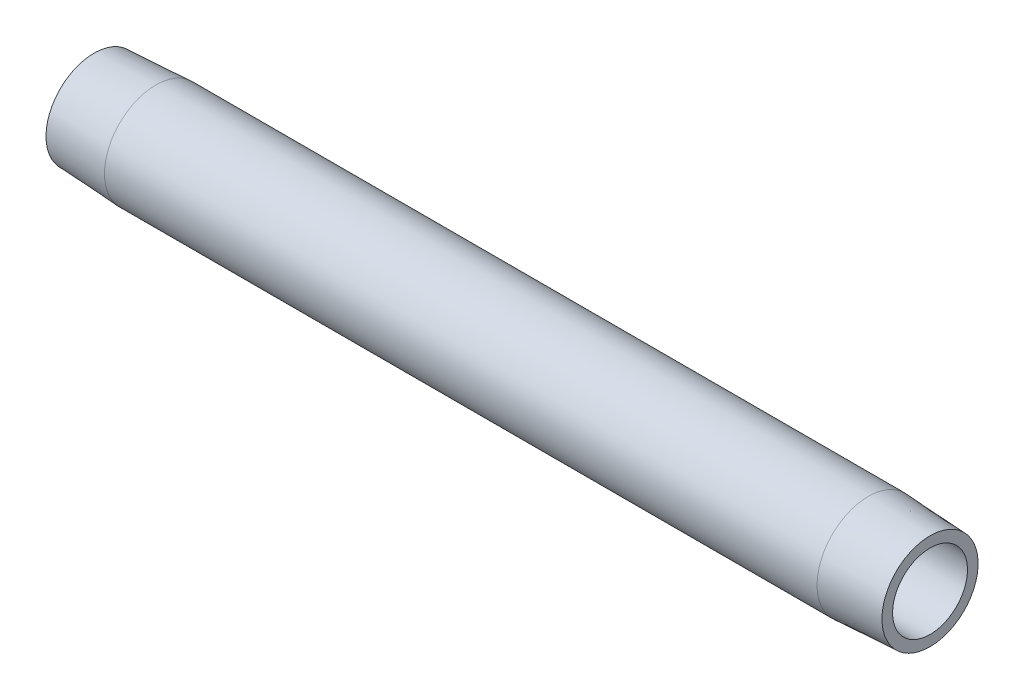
from build123d import *


with BuildPart() as part:
    # Sketch1 → Revolve1 (revolve)
    with BuildSketch(Plane.XY, mode=Mode.PRIVATE) as revolve1_sk:
        Polygon((139.7, 6.2611), (0, 6.2611), (0, 8.032050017), (10.3124, 8.5725), (129.3876, 8.5725), (139.7, 8.032050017), align=None)
    revolve(revolve1_sk.sketch.rotate(Axis((0, 0, 0), (1, 0, 0)), 90), axis=Axis((0, 0, 0), (1, 0, 0)))


solid = part.part
